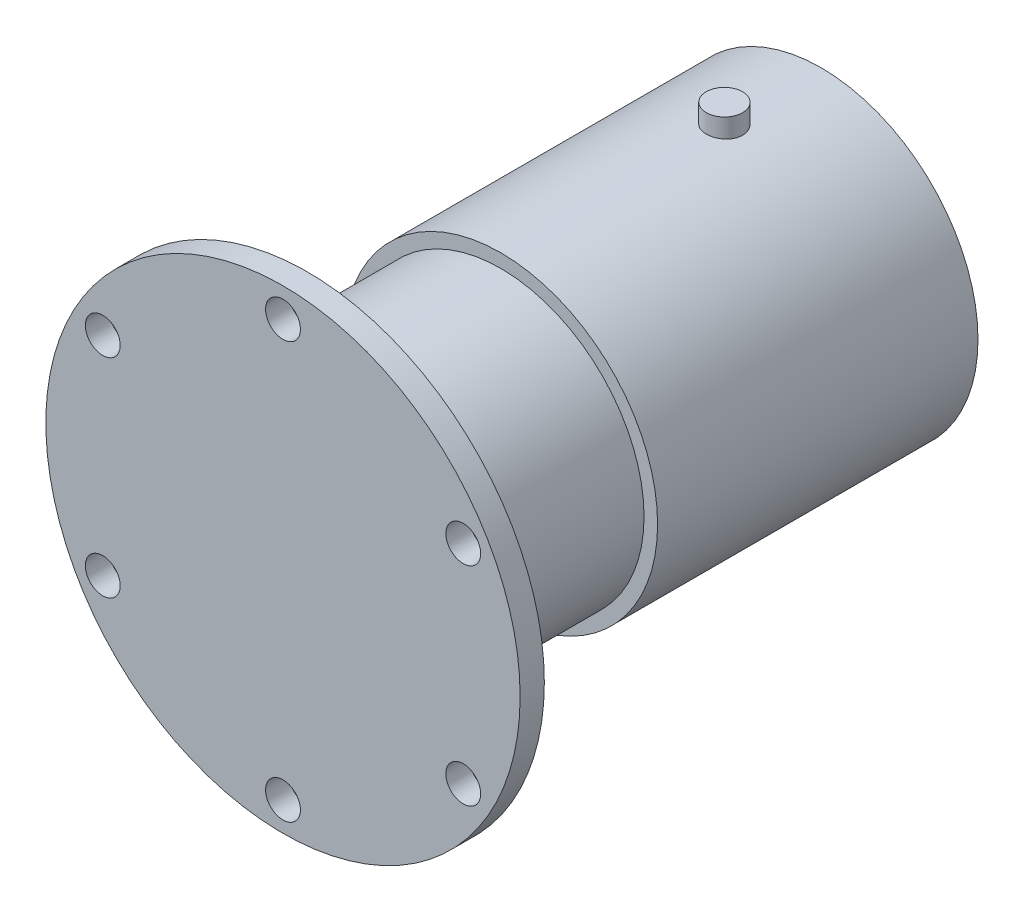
ISO-10303-21;
HEADER;
FILE_DESCRIPTION(('STEP AP214'),'2;1');
FILE_NAME('part.step','',(''),(''),'','','');
FILE_SCHEMA(('AUTOMOTIVE_DESIGN { 1 0 10303 214 1 1 1 1 }'));
ENDSEC;
DATA;
#1=APPLICATION_CONTEXT('core data for automotive mechanical design processes');
#2=APPLICATION_PROTOCOL_DEFINITION('international standard','automotive_design',2000,#1);
#3=PRODUCT_CONTEXT('',#1,'mechanical');
#4=PRODUCT('Part','Part','',(#3));
#5=PRODUCT_RELATED_PRODUCT_CATEGORY('part','',(#4));
#6=PRODUCT_DEFINITION_FORMATION('','',#4);
#7=PRODUCT_DEFINITION_CONTEXT('part definition',#1,'design');
#8=PRODUCT_DEFINITION('design','',#6,#7);
#9=PRODUCT_DEFINITION_SHAPE('','',#8);
#10=(LENGTH_UNIT() NAMED_UNIT(*) SI_UNIT(.MILLI.,.METRE.));
#11=(NAMED_UNIT(*) PLANE_ANGLE_UNIT() SI_UNIT($,.RADIAN.));
#12=(NAMED_UNIT(*) SI_UNIT($,.STERADIAN.) SOLID_ANGLE_UNIT());
#13=UNCERTAINTY_MEASURE_WITH_UNIT(LENGTH_MEASURE(1.E-05),#10,'distance_accuracy_value','');
#14=(GEOMETRIC_REPRESENTATION_CONTEXT(3) GLOBAL_UNCERTAINTY_ASSIGNED_CONTEXT((#13)) GLOBAL_UNIT_ASSIGNED_CONTEXT((#10,
#11,#12)) REPRESENTATION_CONTEXT('',''));
#15=CARTESIAN_POINT('',(0.,0.,0.));
#16=DIRECTION('',(0.,0.,1.));
#17=DIRECTION('',(1.,0.,0.));
#18=AXIS2_PLACEMENT_3D('',#15,#16,#17);
#19=CARTESIAN_POINT('',(0.,0.,-6.35));
#20=DIRECTION('',(0.,0.,-1.));
#21=DIRECTION('',(1.,0.,0.));
#22=AXIS2_PLACEMENT_3D('',#19,#20,#21);
#23=PLANE('',#22);
#24=CARTESIAN_POINT('',(-47.2936473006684,-27.3049999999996,-6.35));
#25=DIRECTION('',(0.,0.,-1.));
#26=DIRECTION('',(0.499999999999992,-0.866025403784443,0.));
#27=AXIS2_PLACEMENT_3D('',#24,#25,#26);
#28=CIRCLE('',#27,4.572);
#29=CARTESIAN_POINT('',(-45.0076473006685,-31.264468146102,-6.35));
#30=VERTEX_POINT('',#29);
#31=EDGE_CURVE('E71',#30,#30,#28,.T.);
#32=ORIENTED_EDGE('',*,*,#31,.F.);
#33=EDGE_LOOP('',(#32));
#34=FACE_BOUND('',#33,.T.);
#35=CARTESIAN_POINT('',(47.2936473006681,-27.3050000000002,-6.35));
#36=DIRECTION('',(0.,0.,-1.));
#37=DIRECTION('',(0.500000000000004,0.866025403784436,0.));
#38=AXIS2_PLACEMENT_3D('',#35,#36,#37);
#39=CIRCLE('',#38,4.572);
#40=CARTESIAN_POINT('',(49.5796473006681,-23.3455318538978,-6.35));
#41=VERTEX_POINT('',#40);
#42=EDGE_CURVE('E59',#41,#41,#39,.T.);
#43=ORIENTED_EDGE('',*,*,#42,.F.);
#44=EDGE_LOOP('',(#43));
#45=FACE_BOUND('',#44,.T.);
#46=CARTESIAN_POINT('',(0.,54.61,-6.35));
#47=DIRECTION('',(0.,0.,-1.));
#48=DIRECTION('',(-1.,0.,0.));
#49=AXIS2_PLACEMENT_3D('',#46,#47,#48);
#50=CIRCLE('',#49,4.572);
#51=CARTESIAN_POINT('',(-4.572,54.61,-6.35));
#52=VERTEX_POINT('',#51);
#53=EDGE_CURVE('E48',#52,#52,#50,.T.);
#54=ORIENTED_EDGE('',*,*,#53,.F.);
#55=EDGE_LOOP('',(#54));
#56=FACE_BOUND('',#55,.T.);
#57=CARTESIAN_POINT('',(0.,0.,-6.35));
#58=DIRECTION('',(0.,0.,1.));
#59=DIRECTION('',(1.,0.,0.));
#60=AXIS2_PLACEMENT_3D('',#57,#58,#59);
#61=CIRCLE('',#60,62.23);
#62=CARTESIAN_POINT('',(62.23,0.,-6.35));
#63=VERTEX_POINT('',#62);
#64=EDGE_CURVE('E11',#63,#63,#61,.T.);
#65=ORIENTED_EDGE('',*,*,#64,.F.);
#66=EDGE_LOOP('',(#65));
#67=FACE_BOUND('',#66,.T.);
#68=CARTESIAN_POINT('',(47.2936473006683,27.3049999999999,-6.35));
#69=DIRECTION('',(0.,0.,-1.));
#70=DIRECTION('',(-0.499999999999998,0.86602540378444,0.));
#71=AXIS2_PLACEMENT_3D('',#68,#69,#70);
#72=CIRCLE('',#71,4.572);
#73=CARTESIAN_POINT('',(45.0076473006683,31.2644681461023,-6.35));
#74=VERTEX_POINT('',#73);
#75=EDGE_CURVE('E53',#74,#74,#72,.T.);
#76=ORIENTED_EDGE('',*,*,#75,.F.);
#77=EDGE_LOOP('',(#76));
#78=FACE_BOUND('',#77,.T.);
#79=CARTESIAN_POINT('',(-3.81339812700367E-13,-54.61,-6.35));
#80=DIRECTION('',(0.,0.,-1.));
#81=DIRECTION('',(1.,0.,0.));
#82=AXIS2_PLACEMENT_3D('',#79,#80,#81);
#83=CIRCLE('',#82,4.572);
#84=CARTESIAN_POINT('',(4.57199999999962,-54.61,-6.35));
#85=VERTEX_POINT('',#84);
#86=EDGE_CURVE('E65',#85,#85,#83,.T.);
#87=ORIENTED_EDGE('',*,*,#86,.F.);
#88=EDGE_LOOP('',(#87));
#89=FACE_BOUND('',#88,.T.);
#90=CARTESIAN_POINT('',(-47.2936473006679,27.3050000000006,-6.35));
#91=DIRECTION('',(0.,0.,-1.));
#92=DIRECTION('',(-0.50000000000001,-0.866025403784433,0.));
#93=AXIS2_PLACEMENT_3D('',#90,#91,#92);
#94=CIRCLE('',#93,4.572);
#95=CARTESIAN_POINT('',(-49.5796473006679,23.3455318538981,-6.35));
#96=VERTEX_POINT('',#95);
#97=EDGE_CURVE('E77',#96,#96,#94,.T.);
#98=ORIENTED_EDGE('',*,*,#97,.F.);
#99=EDGE_LOOP('',(#98));
#100=FACE_BOUND('',#99,.T.);
#101=ADVANCED_FACE('F33',(#34,#45,#56,#67,#78,#89,#100),#23,.T.);
#102=CARTESIAN_POINT('',(0.,0.,0.));
#103=DIRECTION('',(0.,0.,-1.));
#104=DIRECTION('',(1.,0.,0.));
#105=AXIS2_PLACEMENT_3D('',#102,#103,#104);
#106=PLANE('',#105);
#107=CARTESIAN_POINT('',(-47.2936473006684,-27.3049999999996,0.));
#108=DIRECTION('',(0.,0.,-1.));
#109=DIRECTION('',(0.499999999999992,-0.866025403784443,0.));
#110=AXIS2_PLACEMENT_3D('',#107,#108,#109);
#111=CIRCLE('',#110,4.572);
#112=CARTESIAN_POINT('',(-45.0076473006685,-31.264468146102,0.));
#113=VERTEX_POINT('',#112);
#114=EDGE_CURVE('E74',#113,#113,#111,.T.);
#115=ORIENTED_EDGE('',*,*,#114,.T.);
#116=EDGE_LOOP('',(#115));
#117=FACE_BOUND('',#116,.T.);
#118=CARTESIAN_POINT('',(47.2936473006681,-27.3050000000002,0.));
#119=DIRECTION('',(0.,0.,-1.));
#120=DIRECTION('',(0.500000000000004,0.866025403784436,0.));
#121=AXIS2_PLACEMENT_3D('',#118,#119,#120);
#122=CIRCLE('',#121,4.572);
#123=CARTESIAN_POINT('',(49.5796473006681,-23.3455318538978,0.));
#124=VERTEX_POINT('',#123);
#125=EDGE_CURVE('E62',#124,#124,#122,.T.);
#126=ORIENTED_EDGE('',*,*,#125,.T.);
#127=EDGE_LOOP('',(#126));
#128=FACE_BOUND('',#127,.T.);
#129=CARTESIAN_POINT('',(0.,54.61,0.));
#130=DIRECTION('',(0.,0.,-1.));
#131=DIRECTION('',(-1.,0.,0.));
#132=AXIS2_PLACEMENT_3D('',#129,#130,#131);
#133=CIRCLE('',#132,4.572);
#134=CARTESIAN_POINT('',(-4.572,54.61,0.));
#135=VERTEX_POINT('',#134);
#136=EDGE_CURVE('E44',#135,#135,#133,.T.);
#137=ORIENTED_EDGE('',*,*,#136,.T.);
#138=EDGE_LOOP('',(#137));
#139=FACE_BOUND('',#138,.T.);
#140=CARTESIAN_POINT('',(0.,0.,0.));
#141=DIRECTION('',(0.,0.,1.));
#142=DIRECTION('',(1.,0.,0.));
#143=AXIS2_PLACEMENT_3D('',#140,#141,#142);
#144=CIRCLE('',#143,62.23);
#145=CARTESIAN_POINT('',(62.23,0.,0.));
#146=VERTEX_POINT('',#145);
#147=EDGE_CURVE('E40',#146,#146,#144,.T.);
#148=ORIENTED_EDGE('',*,*,#147,.T.);
#149=EDGE_LOOP('',(#148));
#150=FACE_BOUND('',#149,.T.);
#151=CARTESIAN_POINT('',(47.2936473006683,27.3049999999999,0.));
#152=DIRECTION('',(0.,0.,-1.));
#153=DIRECTION('',(-0.499999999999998,0.86602540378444,0.));
#154=AXIS2_PLACEMENT_3D('',#151,#152,#153);
#155=CIRCLE('',#154,4.572);
#156=CARTESIAN_POINT('',(45.0076473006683,31.2644681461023,0.));
#157=VERTEX_POINT('',#156);
#158=EDGE_CURVE('E56',#157,#157,#155,.T.);
#159=ORIENTED_EDGE('',*,*,#158,.T.);
#160=EDGE_LOOP('',(#159));
#161=FACE_BOUND('',#160,.T.);
#162=CARTESIAN_POINT('',(-3.81339812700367E-13,-54.61,0.));
#163=DIRECTION('',(0.,0.,-1.));
#164=DIRECTION('',(1.,0.,0.));
#165=AXIS2_PLACEMENT_3D('',#162,#163,#164);
#166=CIRCLE('',#165,4.572);
#167=CARTESIAN_POINT('',(4.57199999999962,-54.61,0.));
#168=VERTEX_POINT('',#167);
#169=EDGE_CURVE('E68',#168,#168,#166,.T.);
#170=ORIENTED_EDGE('',*,*,#169,.T.);
#171=EDGE_LOOP('',(#170));
#172=FACE_BOUND('',#171,.T.);
#173=CARTESIAN_POINT('',(-47.2936473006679,27.3050000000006,0.));
#174=DIRECTION('',(0.,0.,-1.));
#175=DIRECTION('',(-0.50000000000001,-0.866025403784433,0.));
#176=AXIS2_PLACEMENT_3D('',#173,#174,#175);
#177=CIRCLE('',#176,4.572);
#178=CARTESIAN_POINT('',(-49.5796473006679,23.3455318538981,0.));
#179=VERTEX_POINT('',#178);
#180=EDGE_CURVE('E80',#179,#179,#177,.T.);
#181=ORIENTED_EDGE('',*,*,#180,.T.);
#182=EDGE_LOOP('',(#181));
#183=FACE_BOUND('',#182,.T.);
#184=ADVANCED_FACE('F84',(#117,#128,#139,#150,#161,#172,#183),#106,.F.);
#185=CARTESIAN_POINT('',(0.,0.,-6.35));
#186=DIRECTION('',(0.,0.,1.));
#187=DIRECTION('',(-1.,0.,0.));
#188=AXIS2_PLACEMENT_3D('',#185,#186,#187);
#189=CYLINDRICAL_SURFACE('',#188,62.23);
#190=ORIENTED_EDGE('',*,*,#64,.T.);
#191=EDGE_LOOP('',(#190));
#192=FACE_BOUND('',#191,.T.);
#193=ORIENTED_EDGE('',*,*,#147,.F.);
#194=EDGE_LOOP('',(#193));
#195=FACE_BOUND('',#194,.T.);
#196=ADVANCED_FACE('F35',(#192,#195),#189,.T.);
#197=CARTESIAN_POINT('',(0.,54.61,0.));
#198=DIRECTION('',(0.,0.,-1.));
#199=DIRECTION('',(1.,0.,0.));
#200=AXIS2_PLACEMENT_3D('',#197,#198,#199);
#201=CYLINDRICAL_SURFACE('',#200,4.572);
#202=ORIENTED_EDGE('',*,*,#136,.F.);
#203=EDGE_LOOP('',(#202));
#204=FACE_BOUND('',#203,.T.);
#205=ORIENTED_EDGE('',*,*,#53,.T.);
#206=EDGE_LOOP('',(#205));
#207=FACE_BOUND('',#206,.T.);
#208=ADVANCED_FACE('F103',(#204,#207),#201,.F.);
#209=CARTESIAN_POINT('',(47.2936473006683,27.3049999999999,0.));
#210=DIRECTION('',(0.,0.,-1.));
#211=DIRECTION('',(0.499999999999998,-0.86602540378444,0.));
#212=AXIS2_PLACEMENT_3D('',#209,#210,#211);
#213=CYLINDRICAL_SURFACE('',#212,4.572);
#214=ORIENTED_EDGE('',*,*,#158,.F.);
#215=EDGE_LOOP('',(#214));
#216=FACE_BOUND('',#215,.T.);
#217=ORIENTED_EDGE('',*,*,#75,.T.);
#218=EDGE_LOOP('',(#217));
#219=FACE_BOUND('',#218,.T.);
#220=ADVANCED_FACE('F106',(#216,#219),#213,.F.);
#221=CARTESIAN_POINT('',(47.2936473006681,-27.3050000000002,0.));
#222=DIRECTION('',(0.,0.,-1.));
#223=DIRECTION('',(-0.500000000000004,-0.866025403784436,0.));
#224=AXIS2_PLACEMENT_3D('',#221,#222,#223);
#225=CYLINDRICAL_SURFACE('',#224,4.572);
#226=ORIENTED_EDGE('',*,*,#125,.F.);
#227=EDGE_LOOP('',(#226));
#228=FACE_BOUND('',#227,.T.);
#229=ORIENTED_EDGE('',*,*,#42,.T.);
#230=EDGE_LOOP('',(#229));
#231=FACE_BOUND('',#230,.T.);
#232=ADVANCED_FACE('F110',(#228,#231),#225,.F.);
#233=CARTESIAN_POINT('',(-3.81339812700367E-13,-54.61,0.));
#234=DIRECTION('',(0.,0.,-1.));
#235=DIRECTION('',(-1.,0.,0.));
#236=AXIS2_PLACEMENT_3D('',#233,#234,#235);
#237=CYLINDRICAL_SURFACE('',#236,4.572);
#238=ORIENTED_EDGE('',*,*,#169,.F.);
#239=EDGE_LOOP('',(#238));
#240=FACE_BOUND('',#239,.T.);
#241=ORIENTED_EDGE('',*,*,#86,.T.);
#242=EDGE_LOOP('',(#241));
#243=FACE_BOUND('',#242,.T.);
#244=ADVANCED_FACE('F114',(#240,#243),#237,.F.);
#245=CARTESIAN_POINT('',(-47.2936473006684,-27.3049999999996,0.));
#246=DIRECTION('',(0.,0.,-1.));
#247=DIRECTION('',(-0.499999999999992,0.866025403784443,0.));
#248=AXIS2_PLACEMENT_3D('',#245,#246,#247);
#249=CYLINDRICAL_SURFACE('',#248,4.572);
#250=ORIENTED_EDGE('',*,*,#114,.F.);
#251=EDGE_LOOP('',(#250));
#252=FACE_BOUND('',#251,.T.);
#253=ORIENTED_EDGE('',*,*,#31,.T.);
#254=EDGE_LOOP('',(#253));
#255=FACE_BOUND('',#254,.T.);
#256=ADVANCED_FACE('F89',(#252,#255),#249,.F.);
#257=CARTESIAN_POINT('',(-47.2936473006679,27.3050000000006,0.));
#258=DIRECTION('',(0.,0.,-1.));
#259=DIRECTION('',(0.50000000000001,0.866025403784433,0.));
#260=AXIS2_PLACEMENT_3D('',#257,#258,#259);
#261=CYLINDRICAL_SURFACE('',#260,4.572);
#262=ORIENTED_EDGE('',*,*,#180,.F.);
#263=EDGE_LOOP('',(#262));
#264=FACE_BOUND('',#263,.T.);
#265=ORIENTED_EDGE('',*,*,#97,.T.);
#266=EDGE_LOOP('',(#265));
#267=FACE_BOUND('',#266,.T.);
#268=ADVANCED_FACE('F86',(#264,#267),#261,.F.);
#269=CLOSED_SHELL('',(#101,#184,#196,#208,#220,#232,#244,#256,#268));
#270=MANIFOLD_SOLID_BREP('B2',#269);
#271=CARTESIAN_POINT('',(0.,0.,-141.224));
#272=DIRECTION('',(0.,0.,1.));
#273=DIRECTION('',(-1.,0.,0.));
#274=AXIS2_PLACEMENT_3D('',#271,#272,#273);
#275=CYLINDRICAL_SURFACE('',#274,41.148);
#276=CARTESIAN_POINT('',(0.,41.148,-120.5865));
#277=CARTESIAN_POINT('',(0.133323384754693,41.1480004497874,-120.586501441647));
#278=CARTESIAN_POINT('',(0.266625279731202,41.1473507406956,-120.580899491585));
#279=CARTESIAN_POINT('',(0.532321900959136,41.1447709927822,-120.558533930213));
#280=CARTESIAN_POINT('',(0.664716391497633,41.142840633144,-120.541767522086));
#281=CARTESIAN_POINT('',(0.927705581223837,41.1377512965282,-120.497175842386));
#282=CARTESIAN_POINT('',(1.05829884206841,41.1345913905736,-120.469342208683));
#283=CARTESIAN_POINT('',(1.3167058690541,41.1271309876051,-120.402809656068));
#284=CARTESIAN_POINT('',(1.44451859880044,41.1228300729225,-120.364106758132));
#285=CARTESIAN_POINT('',(1.69628101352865,41.1132142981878,-120.276167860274));
#286=CARTESIAN_POINT('',(1.82023450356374,41.1079004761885,-120.226942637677));
#287=CARTESIAN_POINT('',(2.06358982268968,41.0964030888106,-120.118271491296));
#288=CARTESIAN_POINT('',(2.18298995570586,41.0902192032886,-120.058821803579));
#289=CARTESIAN_POINT('',(2.41629126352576,41.0771601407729,-119.930175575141));
#290=CARTESIAN_POINT('',(2.53019546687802,41.0702853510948,-119.860984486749));
#291=CARTESIAN_POINT('',(2.75182654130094,41.0560311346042,-119.713292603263));
#292=CARTESIAN_POINT('',(2.85955110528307,41.0486515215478,-119.634788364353));
#293=CARTESIAN_POINT('',(3.06843487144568,41.0335670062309,-119.468720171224));
#294=CARTESIAN_POINT('',(3.16956705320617,41.025860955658,-119.381122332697));
#295=CARTESIAN_POINT('',(3.36413849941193,41.0103646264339,-119.197701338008));
#296=CARTESIAN_POINT('',(3.45757490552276,41.0025743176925,-119.101875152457));
#297=CARTESIAN_POINT('',(3.6360310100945,40.9871346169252,-118.902726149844));
#298=CARTESIAN_POINT('',(3.72105338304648,40.9794851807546,-118.799405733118));
#299=CARTESIAN_POINT('',(3.88214648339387,40.9645381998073,-118.585926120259));
#300=CARTESIAN_POINT('',(3.95821389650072,40.9572407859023,-118.475764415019));
#301=CARTESIAN_POINT('',(4.10100293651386,40.9431904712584,-118.249109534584));
#302=CARTESIAN_POINT('',(4.16770063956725,40.9364389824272,-118.132601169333));
#303=CARTESIAN_POINT('',(4.29105656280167,40.9236919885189,-117.894331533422));
#304=CARTESIAN_POINT('',(4.34771105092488,40.9176967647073,-117.772568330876));
#305=CARTESIAN_POINT('',(4.50189068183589,40.9011212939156,-117.400764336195));
#306=CARTESIAN_POINT('',(4.58379287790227,40.8919348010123,-117.143953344));
#307=CARTESIAN_POINT('',(4.70288751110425,40.8784093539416,-116.621401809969));
#308=CARTESIAN_POINT('',(4.7402791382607,40.8740488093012,-116.355706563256));
#309=CARTESIAN_POINT('',(4.76999474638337,40.8705920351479,-115.821741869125));
#310=CARTESIAN_POINT('',(4.76232029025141,40.8714956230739,-115.5534725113));
#311=CARTESIAN_POINT('',(4.70226157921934,40.8784481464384,-115.023398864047));
#312=CARTESIAN_POINT('',(4.65009565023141,40.8844719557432,-114.761569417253));
#313=CARTESIAN_POINT('',(4.50288133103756,40.9009462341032,-114.250403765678));
#314=CARTESIAN_POINT('',(4.40783218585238,40.911396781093,-114.001067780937));
#315=CARTESIAN_POINT('',(4.17731072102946,40.9355758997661,-113.521287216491));
#316=CARTESIAN_POINT('',(4.0417427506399,40.9493122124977,-113.290889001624));
#317=CARTESIAN_POINT('',(3.73410090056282,40.9785088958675,-112.856031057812));
#318=CARTESIAN_POINT('',(3.56202558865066,40.9939693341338,-112.651572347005));
#319=CARTESIAN_POINT('',(3.18503994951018,41.0249841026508,-112.273129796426));
#320=CARTESIAN_POINT('',(2.97994131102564,41.0405384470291,-112.099333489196));
#321=CARTESIAN_POINT('',(2.5433815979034,41.0699025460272,-111.788606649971));
#322=CARTESIAN_POINT('',(2.31192047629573,41.0837122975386,-111.651676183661));
#323=CARTESIAN_POINT('',(1.82906731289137,41.1080381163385,-111.418570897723));
#324=CARTESIAN_POINT('',(1.57766998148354,41.1185533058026,-111.322406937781));
#325=CARTESIAN_POINT('',(1.06214786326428,41.1350969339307,-111.173708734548));
#326=CARTESIAN_POINT('',(0.798023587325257,41.1411255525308,-111.121172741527));
#327=CARTESIAN_POINT('',(0.26616758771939,41.1479935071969,-111.061462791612));
#328=CARTESIAN_POINT('',(-0.001534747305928,41.1488624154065,-111.054030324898));
#329=CARTESIAN_POINT('',(-0.534371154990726,41.1453926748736,-111.084057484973));
#330=CARTESIAN_POINT('',(-0.799505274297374,41.1410541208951,-111.121516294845));
#331=CARTESIAN_POINT('',(-1.31892287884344,41.1276755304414,-111.240048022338));
#332=CARTESIAN_POINT('',(-1.57323466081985,41.1186486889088,-111.320998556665));
#333=CARTESIAN_POINT('',(-2.06467161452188,41.0969049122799,-111.524089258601));
#334=CARTESIAN_POINT('',(-2.30179627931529,41.0841878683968,-111.646230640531));
#335=CARTESIAN_POINT('',(-2.75328812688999,41.0564095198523,-111.928867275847));
#336=CARTESIAN_POINT('',(-2.96754933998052,41.0413380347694,-112.089530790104));
#337=CARTESIAN_POINT('',(-3.36615611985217,41.0105710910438,-112.444412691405));
#338=CARTESIAN_POINT('',(-3.55050067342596,40.9948756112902,-112.638632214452));
#339=CARTESIAN_POINT('',(-3.88495108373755,40.9645391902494,-113.056243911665));
#340=CARTESIAN_POINT('',(-4.03488624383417,40.9499037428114,-113.279773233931));
#341=CARTESIAN_POINT('',(-4.29508349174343,40.9234327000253,-113.749002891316));
#342=CARTESIAN_POINT('',(-4.4053462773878,40.9115970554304,-113.994702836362));
#343=CARTESIAN_POINT('',(-4.58279366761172,40.8921006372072,-114.500684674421));
#344=CARTESIAN_POINT('',(-4.65007660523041,40.8844303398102,-114.760931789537));
#345=CARTESIAN_POINT('',(-4.73995365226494,40.8741101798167,-115.289270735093));
#346=CARTESIAN_POINT('',(-4.76254952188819,40.8714601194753,-115.557362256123));
#347=CARTESIAN_POINT('',(-4.76247514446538,40.871464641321,-115.958421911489));
#348=CARTESIAN_POINT('',(-4.75684393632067,40.8721229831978,-116.09160420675));
#349=CARTESIAN_POINT('',(-4.73444955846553,40.8747238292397,-116.357003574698));
#350=CARTESIAN_POINT('',(-4.71769052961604,40.8766658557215,-116.489220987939));
#351=CARTESIAN_POINT('',(-4.67315094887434,40.8817814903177,-116.751801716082));
#352=CARTESIAN_POINT('',(-4.64536637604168,40.8849555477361,-116.882164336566));
#353=CARTESIAN_POINT('',(-4.57899463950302,40.8924421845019,-117.140027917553));
#354=CARTESIAN_POINT('',(-4.54041141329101,40.8967543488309,-117.267529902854));
#355=CARTESIAN_POINT('',(-4.45271408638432,40.906395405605,-117.518832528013));
#356=CARTESIAN_POINT('',(-4.40359895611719,40.9117243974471,-117.642632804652));
#357=CARTESIAN_POINT('',(-4.29521401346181,40.9232453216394,-117.885609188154));
#358=CARTESIAN_POINT('',(-4.23594789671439,40.9294369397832,-118.004786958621));
#359=CARTESIAN_POINT('',(-4.10764755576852,40.9425120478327,-118.237779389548));
#360=CARTESIAN_POINT('',(-4.03860980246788,40.9493957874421,-118.351592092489));
#361=CARTESIAN_POINT('',(-3.89129627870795,40.9636569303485,-118.572980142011));
#362=CARTESIAN_POINT('',(-3.81302384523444,40.9710341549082,-118.680557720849));
#363=CARTESIAN_POINT('',(-3.64726447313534,40.9861236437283,-118.889411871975));
#364=CARTESIAN_POINT('',(-3.5597243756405,40.9938376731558,-118.990646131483));
#365=CARTESIAN_POINT('',(-3.37647466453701,41.0093376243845,-119.185352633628));
#366=CARTESIAN_POINT('',(-3.28076803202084,41.0171235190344,-119.278827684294));
#367=CARTESIAN_POINT('',(-3.08176585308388,41.0325552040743,-119.457457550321));
#368=CARTESIAN_POINT('',(-2.97846574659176,41.040200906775,-119.542607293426));
#369=CARTESIAN_POINT('',(-2.76508888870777,41.0551290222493,-119.703892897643));
#370=CARTESIAN_POINT('',(-2.65501465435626,41.0624115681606,-119.78003207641));
#371=CARTESIAN_POINT('',(-2.42840911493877,41.0764368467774,-119.923055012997));
#372=CARTESIAN_POINT('',(-2.31185564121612,41.0831775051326,-119.989903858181));
#373=CARTESIAN_POINT('',(-2.07352990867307,41.095895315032,-120.113509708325));
#374=CARTESIAN_POINT('',(-1.95175957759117,41.10187274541,-120.170270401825));
#375=CARTESIAN_POINT('',(-1.70391949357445,41.1128925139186,-120.273275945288));
#376=CARTESIAN_POINT('',(-1.57785325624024,41.1179355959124,-120.319529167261));
#377=CARTESIAN_POINT('',(-1.32227290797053,41.1269480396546,-120.401226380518));
#378=CARTESIAN_POINT('',(-1.19275963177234,41.1309176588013,-120.43667296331));
#379=CARTESIAN_POINT('',(-0.888007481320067,41.1387843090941,-120.506378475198));
#380=CARTESIAN_POINT('',(-0.711769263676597,41.1422260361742,-120.536393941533));
#381=CARTESIAN_POINT('',(-0.357007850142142,41.1468335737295,-120.576453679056));
#382=CARTESIAN_POINT('',(-0.178484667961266,41.147999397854,-120.586498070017));
#383=CARTESIAN_POINT('',(0.,41.148,-120.5865));
#384=B_SPLINE_CURVE_WITH_KNOTS('',3,(#276,#277,#278,#279,#280,#281,#282,#283,#284,#285,#286,
#287,#288,#289,#290,#291,#292,#293,#294,#295,#296,#297,#298,#299,#300,#301,#302,#303,#304,#305,
#306,#307,#308,#309,#310,#311,#312,#313,#314,#315,#316,#317,#318,#319,#320,#321,#322,#323,#324,
#325,#326,#327,#328,#329,#330,#331,#332,#333,#334,#335,#336,#337,#338,#339,#340,#341,#342,#343,
#344,#345,#346,#347,#348,#349,#350,#351,#352,#353,#354,#355,#356,#357,#358,#359,#360,#361,#362,
#363,#364,#365,#366,#367,#368,#369,#370,#371,#372,#373,#374,#375,#376,#377,#378,#379,#380,#381,
#382,#383),.UNSPECIFIED.,.T.,.F.,(4,2,2,2,2,2,2,2,2,2,2,2,2,2,2,2,2,2,2,2,2,2,2,2,2,2,2,2,2,2,2,
2,2,2,2,2,2,2,2,2,2,2,2,2,2,2,2,2,2,2,2,2,2,4),(0.,0.399814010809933,0.799728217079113,
1.19994516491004,1.60030881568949,2.00026434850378,2.40036743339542,2.80024746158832,
3.20027582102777,3.60185224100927,4.00357714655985,4.40517394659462,4.8069189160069,
5.20967171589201,5.61257386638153,6.41748175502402,7.21877388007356,8.02003821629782,
8.81739311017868,9.61476204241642,10.4140283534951,11.2133260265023,12.0173544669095,
12.8213843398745,13.6256282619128,14.429839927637,15.2294378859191,16.0290212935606,
16.8263664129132,17.623735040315,18.424652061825,19.2255962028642,20.030431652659,
20.8352529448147,21.6382262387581,22.4411679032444,22.8406878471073,23.2400592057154,
23.6395763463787,24.0389480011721,24.4383587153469,24.8376243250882,25.2370345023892,
25.6363007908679,26.0379959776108,26.4395451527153,26.841337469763,27.2429813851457,
27.6460960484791,28.0490630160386,28.451707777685,28.8542559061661,29.3895040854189,
29.9247490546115),.UNSPECIFIED.);
#385=CARTESIAN_POINT('',(0.,41.148,-120.5865));
#386=VERTEX_POINT('',#385);
#387=EDGE_CURVE('E207',#386,#386,#384,.T.);
#388=ORIENTED_EDGE('',*,*,#387,.T.);
#389=EDGE_LOOP('',(#388));
#390=FACE_BOUND('',#389,.T.);
#391=CARTESIAN_POINT('',(0.,0.,-141.224));
#392=DIRECTION('',(0.,0.,1.));
#393=DIRECTION('',(1.,0.,0.));
#394=AXIS2_PLACEMENT_3D('',#391,#392,#393);
#395=CIRCLE('',#394,41.148);
#396=CARTESIAN_POINT('',(41.148,0.,-141.224));
#397=VERTEX_POINT('',#396);
#398=EDGE_CURVE('E32',#397,#397,#395,.T.);
#399=ORIENTED_EDGE('',*,*,#398,.T.);
#400=EDGE_LOOP('',(#399));
#401=FACE_BOUND('',#400,.T.);
#402=CARTESIAN_POINT('',(0.,0.,-57.15));
#403=DIRECTION('',(0.,0.,1.));
#404=DIRECTION('',(1.,0.,0.));
#405=AXIS2_PLACEMENT_3D('',#402,#403,#404);
#406=CIRCLE('',#405,41.148);
#407=CARTESIAN_POINT('',(41.148,0.,-57.15));
#408=VERTEX_POINT('',#407);
#409=EDGE_CURVE('E194',#408,#408,#406,.T.);
#410=ORIENTED_EDGE('',*,*,#409,.F.);
#411=EDGE_LOOP('',(#410));
#412=FACE_BOUND('',#411,.T.);
#413=ADVANCED_FACE('F188',(#390,#401,#412),#275,.T.);
#414=CARTESIAN_POINT('',(0.,0.,-141.224));
#415=DIRECTION('',(0.,0.,-1.));
#416=DIRECTION('',(1.,0.,0.));
#417=AXIS2_PLACEMENT_3D('',#414,#415,#416);
#418=PLANE('',#417);
#419=CARTESIAN_POINT('',(0.,0.,-141.224));
#420=DIRECTION('',(0.,0.,1.));
#421=DIRECTION('',(1.,0.,0.));
#422=AXIS2_PLACEMENT_3D('',#419,#420,#421);
#423=CIRCLE('',#422,33.02);
#424=CARTESIAN_POINT('',(33.02,0.,-141.224));
#425=VERTEX_POINT('',#424);
#426=EDGE_CURVE('E202',#425,#425,#423,.T.);
#427=ORIENTED_EDGE('',*,*,#426,.T.);
#428=EDGE_LOOP('',(#427));
#429=FACE_BOUND('',#428,.T.);
#430=ORIENTED_EDGE('',*,*,#398,.F.);
#431=EDGE_LOOP('',(#430));
#432=FACE_BOUND('',#431,.T.);
#433=ADVANCED_FACE('F233',(#429,#432),#418,.T.);
#434=CARTESIAN_POINT('',(0.,0.,-57.15));
#435=DIRECTION('',(0.,0.,-1.));
#436=DIRECTION('',(1.,0.,0.));
#437=AXIS2_PLACEMENT_3D('',#434,#435,#436);
#438=PLANE('',#437);
#439=ORIENTED_EDGE('',*,*,#409,.T.);
#440=EDGE_LOOP('',(#439));
#441=FACE_BOUND('',#440,.T.);
#442=ADVANCED_FACE('F230',(#441),#438,.F.);
#443=CARTESIAN_POINT('',(0.,0.,-87.884));
#444=DIRECTION('',(0.,0.,-1.));
#445=DIRECTION('',(1.,0.,0.));
#446=AXIS2_PLACEMENT_3D('',#443,#444,#445);
#447=CYLINDRICAL_SURFACE('',#446,33.02);
#448=CARTESIAN_POINT('',(0.,0.,-87.884));
#449=DIRECTION('',(0.,0.,1.));
#450=DIRECTION('',(1.,0.,0.));
#451=AXIS2_PLACEMENT_3D('',#448,#449,#450);
#452=CIRCLE('',#451,33.02);
#453=CARTESIAN_POINT('',(33.02,0.,-87.884));
#454=VERTEX_POINT('',#453);
#455=EDGE_CURVE('E198',#454,#454,#452,.T.);
#456=ORIENTED_EDGE('',*,*,#455,.T.);
#457=EDGE_LOOP('',(#456));
#458=FACE_BOUND('',#457,.T.);
#459=ORIENTED_EDGE('',*,*,#426,.F.);
#460=EDGE_LOOP('',(#459));
#461=FACE_BOUND('',#460,.T.);
#462=ADVANCED_FACE('F226',(#458,#461),#447,.F.);
#463=CARTESIAN_POINT('',(0.,0.,-87.884));
#464=DIRECTION('',(0.,0.,-1.));
#465=DIRECTION('',(1.,0.,0.));
#466=AXIS2_PLACEMENT_3D('',#463,#464,#465);
#467=PLANE('',#466);
#468=ORIENTED_EDGE('',*,*,#455,.F.);
#469=EDGE_LOOP('',(#468));
#470=FACE_BOUND('',#469,.T.);
#471=ADVANCED_FACE('F222',(#470),#467,.T.);
#472=CARTESIAN_POINT('',(0.,-62.231,-115.824));
#473=DIRECTION('',(0.,1.,0.));
#474=DIRECTION('',(0.,0.,-1.));
#475=AXIS2_PLACEMENT_3D('',#472,#473,#474);
#476=CYLINDRICAL_SURFACE('',#475,4.7625);
#477=ORIENTED_EDGE('',*,*,#387,.F.);
#478=EDGE_LOOP('',(#477));
#479=FACE_BOUND('',#478,.T.);
#480=CARTESIAN_POINT('',(0.,46.0248,-115.824));
#481=DIRECTION('',(0.,-1.,0.));
#482=DIRECTION('',(0.,0.,-1.));
#483=AXIS2_PLACEMENT_3D('',#480,#481,#482);
#484=CIRCLE('',#483,4.7625);
#485=CARTESIAN_POINT('',(0.,46.0248,-120.5865));
#486=VERTEX_POINT('',#485);
#487=EDGE_CURVE('E214',#486,#486,#484,.T.);
#488=ORIENTED_EDGE('',*,*,#487,.T.);
#489=EDGE_LOOP('',(#488));
#490=FACE_BOUND('',#489,.T.);
#491=ADVANCED_FACE('F217',(#479,#490),#476,.T.);
#492=CARTESIAN_POINT('',(0.,46.0248,-115.824));
#493=DIRECTION('',(0.,1.,0.));
#494=DIRECTION('',(0.,0.,-1.));
#495=AXIS2_PLACEMENT_3D('',#492,#493,#494);
#496=PLANE('',#495);
#497=ORIENTED_EDGE('',*,*,#487,.F.);
#498=EDGE_LOOP('',(#497));
#499=FACE_BOUND('',#498,.T.);
#500=ADVANCED_FACE('F221',(#499),#496,.T.);
#501=CLOSED_SHELL('',(#413,#433,#442,#462,#471,#491,#500));
#502=MANIFOLD_SOLID_BREP('B6',#501);
#503=CARTESIAN_POINT('',(0.,0.,-57.15));
#504=DIRECTION('',(0.,0.,1.));
#505=DIRECTION('',(-1.,0.,0.));
#506=AXIS2_PLACEMENT_3D('',#503,#504,#505);
#507=CYLINDRICAL_SURFACE('',#506,37.592);
#508=CARTESIAN_POINT('',(0.,0.,-57.15));
#509=DIRECTION('',(0.,0.,1.));
#510=DIRECTION('',(1.,0.,0.));
#511=AXIS2_PLACEMENT_3D('',#508,#509,#510);
#512=CIRCLE('',#511,37.592);
#513=CARTESIAN_POINT('',(37.592,0.,-57.15));
#514=VERTEX_POINT('',#513);
#515=EDGE_CURVE('E187',#514,#514,#512,.T.);
#516=ORIENTED_EDGE('',*,*,#515,.T.);
#517=EDGE_LOOP('',(#516));
#518=FACE_BOUND('',#517,.T.);
#519=CARTESIAN_POINT('',(0.,0.,-6.35));
#520=DIRECTION('',(0.,0.,1.));
#521=DIRECTION('',(1.,0.,0.));
#522=AXIS2_PLACEMENT_3D('',#519,#520,#521);
#523=CIRCLE('',#522,37.592);
#524=CARTESIAN_POINT('',(37.592,0.,-6.35));
#525=VERTEX_POINT('',#524);
#526=EDGE_CURVE('E288',#525,#525,#523,.T.);
#527=ORIENTED_EDGE('',*,*,#526,.F.);
#528=EDGE_LOOP('',(#527));
#529=FACE_BOUND('',#528,.T.);
#530=ADVANCED_FACE('F282',(#518,#529),#507,.T.);
#531=CARTESIAN_POINT('',(0.,0.,-57.15));
#532=DIRECTION('',(0.,0.,-1.));
#533=DIRECTION('',(1.,0.,0.));
#534=AXIS2_PLACEMENT_3D('',#531,#532,#533);
#535=PLANE('',#534);
#536=ORIENTED_EDGE('',*,*,#515,.F.);
#537=EDGE_LOOP('',(#536));
#538=FACE_BOUND('',#537,.T.);
#539=ADVANCED_FACE('F297',(#538),#535,.T.);
#540=CARTESIAN_POINT('',(0.,0.,-6.35));
#541=DIRECTION('',(0.,0.,-1.));
#542=DIRECTION('',(1.,0.,0.));
#543=AXIS2_PLACEMENT_3D('',#540,#541,#542);
#544=PLANE('',#543);
#545=ORIENTED_EDGE('',*,*,#526,.T.);
#546=EDGE_LOOP('',(#545));
#547=FACE_BOUND('',#546,.T.);
#548=ADVANCED_FACE('F294',(#547),#544,.F.);
#549=CLOSED_SHELL('',(#530,#539,#548));
#550=MANIFOLD_SOLID_BREP('B27',#549);
#551=ADVANCED_BREP_SHAPE_REPRESENTATION('',(#18,#270,#502,#550),#14);
#552=SHAPE_DEFINITION_REPRESENTATION(#9,#551);
ENDSEC;
END-ISO-10303-21;
